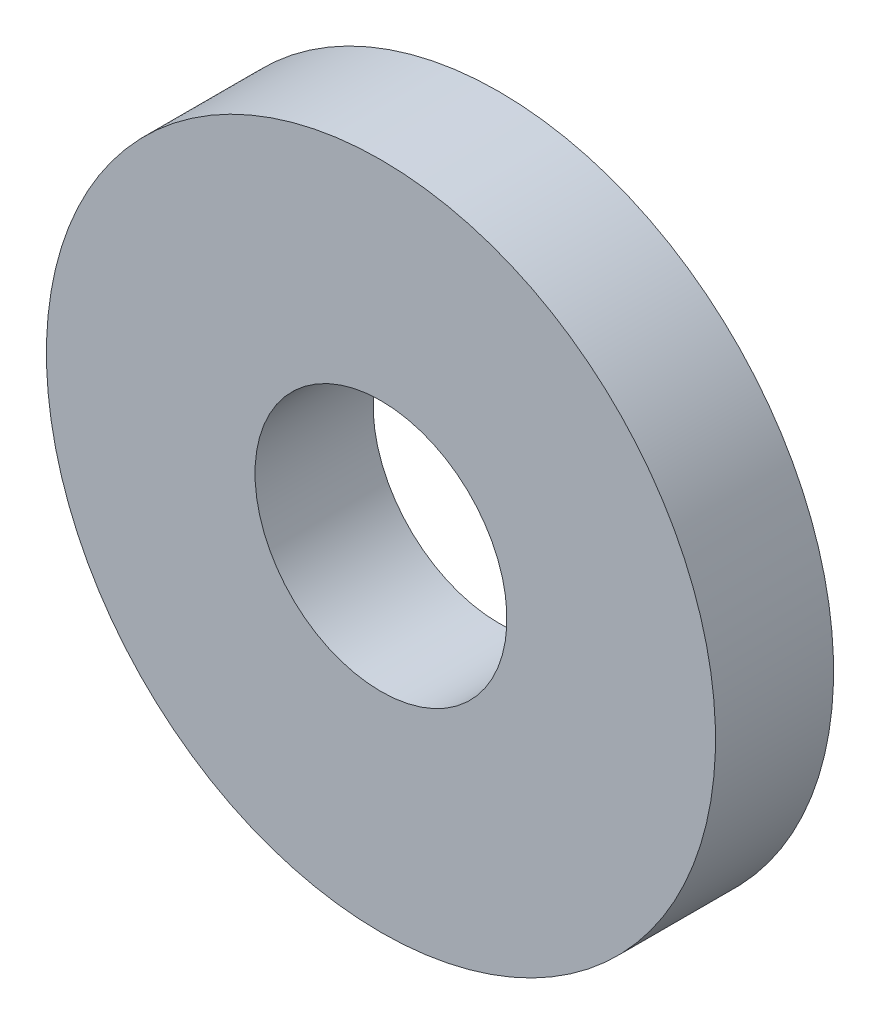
from build123d import *

# Parameters (mm, degrees)
SKETCH1_W = 3
SKETCH1_H = 5.3


with BuildPart() as part:
    # Sketch1 → Revolve1 (revolve)
    with BuildSketch(Plane(origin=(0, 0, 0), x_dir=(0, 0, -1), z_dir=(1, 0, 0)), mode=Mode.PRIVATE) as revolve1_sk:
        with Locations((-1.5, 5.85)):
            Rectangle(SKETCH1_W, SKETCH1_H)
    revolve(revolve1_sk.sketch.rotate(Axis((0, 0, 3), (0, 0, -1)), 180), axis=Axis((0, 0, 3), (0, 0, -1)))


solid = part.part
